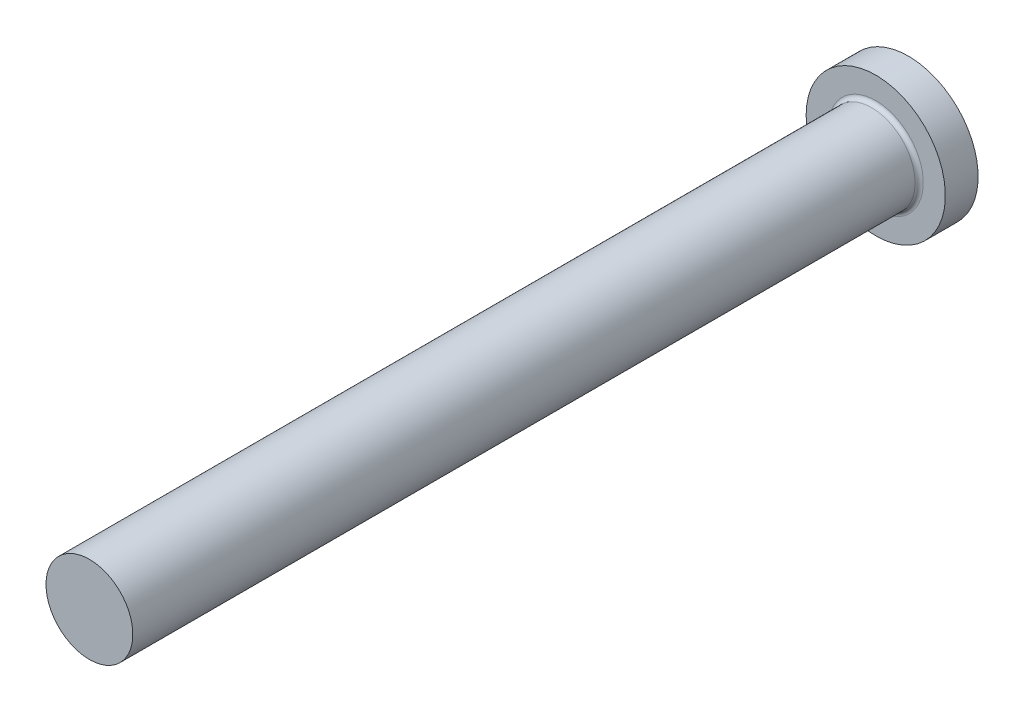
ISO-10303-21;
HEADER;
FILE_DESCRIPTION(('STEP AP214'),'2;1');
FILE_NAME('part.step','',(''),(''),'','','');
FILE_SCHEMA(('AUTOMOTIVE_DESIGN { 1 0 10303 214 1 1 1 1 }'));
ENDSEC;
DATA;
#1=APPLICATION_CONTEXT('core data for automotive mechanical design processes');
#2=APPLICATION_PROTOCOL_DEFINITION('international standard','automotive_design',2000,#1);
#3=PRODUCT_CONTEXT('',#1,'mechanical');
#4=PRODUCT('Part','Part','',(#3));
#5=PRODUCT_RELATED_PRODUCT_CATEGORY('part','',(#4));
#6=PRODUCT_DEFINITION_FORMATION('','',#4);
#7=PRODUCT_DEFINITION_CONTEXT('part definition',#1,'design');
#8=PRODUCT_DEFINITION('design','',#6,#7);
#9=PRODUCT_DEFINITION_SHAPE('','',#8);
#10=(LENGTH_UNIT() NAMED_UNIT(*) SI_UNIT(.MILLI.,.METRE.));
#11=(NAMED_UNIT(*) PLANE_ANGLE_UNIT() SI_UNIT($,.RADIAN.));
#12=(NAMED_UNIT(*) SI_UNIT($,.STERADIAN.) SOLID_ANGLE_UNIT());
#13=UNCERTAINTY_MEASURE_WITH_UNIT(LENGTH_MEASURE(1.E-05),#10,'distance_accuracy_value','');
#14=(GEOMETRIC_REPRESENTATION_CONTEXT(3) GLOBAL_UNCERTAINTY_ASSIGNED_CONTEXT((#13)) GLOBAL_UNIT_ASSIGNED_CONTEXT((#10,
#11,#12)) REPRESENTATION_CONTEXT('',''));
#15=CARTESIAN_POINT('',(0.,0.,0.));
#16=DIRECTION('',(0.,0.,1.));
#17=DIRECTION('',(1.,0.,0.));
#18=AXIS2_PLACEMENT_3D('',#15,#16,#17);
#19=CARTESIAN_POINT('',(8.5,0.,4.));
#20=DIRECTION('',(0.,0.,-1.));
#21=DIRECTION('',(-1.,0.,0.));
#22=AXIS2_PLACEMENT_3D('',#19,#20,#21);
#23=PLANE('',#22);
#24=CARTESIAN_POINT('',(0.,0.,4.));
#25=DIRECTION('',(0.,0.,-1.));
#26=DIRECTION('',(-1.,0.,0.));
#27=AXIS2_PLACEMENT_3D('',#24,#25,#26);
#28=CIRCLE('',#27,5.80000000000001);
#29=CARTESIAN_POINT('',(-5.80000000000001,0.,4.));
#30=VERTEX_POINT('',#29);
#31=EDGE_CURVE('E40',#30,#30,#28,.T.);
#32=ORIENTED_EDGE('',*,*,#31,.T.);
#33=EDGE_LOOP('',(#32));
#34=FACE_BOUND('',#33,.T.);
#35=CARTESIAN_POINT('',(0.,0.,4.));
#36=DIRECTION('',(0.,0.,-1.));
#37=DIRECTION('',(-1.,0.,0.));
#38=AXIS2_PLACEMENT_3D('',#35,#36,#37);
#39=CIRCLE('',#38,8.5);
#40=CARTESIAN_POINT('',(-8.5,0.,4.));
#41=VERTEX_POINT('',#40);
#42=EDGE_CURVE('E44',#41,#41,#39,.T.);
#43=ORIENTED_EDGE('',*,*,#42,.F.);
#44=EDGE_LOOP('',(#43));
#45=FACE_BOUND('',#44,.T.);
#46=ADVANCED_FACE('F33',(#34,#45),#23,.F.);
#47=CARTESIAN_POINT('',(0.,0.,-9.03322817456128));
#48=DIRECTION('',(0.,0.,-1.));
#49=DIRECTION('',(-1.,0.,0.));
#50=AXIS2_PLACEMENT_3D('',#47,#48,#49);
#51=CYLINDRICAL_SURFACE('',#50,8.5);
#52=CARTESIAN_POINT('',(0.,0.,0.));
#53=DIRECTION('',(0.,0.,-1.));
#54=DIRECTION('',(-1.,0.,0.));
#55=AXIS2_PLACEMENT_3D('',#52,#53,#54);
#56=CIRCLE('',#55,8.5);
#57=CARTESIAN_POINT('',(-8.5,0.,0.));
#58=VERTEX_POINT('',#57);
#59=EDGE_CURVE('E48',#58,#58,#56,.T.);
#60=ORIENTED_EDGE('',*,*,#59,.F.);
#61=EDGE_LOOP('',(#60));
#62=FACE_BOUND('',#61,.T.);
#63=ORIENTED_EDGE('',*,*,#42,.T.);
#64=EDGE_LOOP('',(#63));
#65=FACE_BOUND('',#64,.T.);
#66=ADVANCED_FACE('F68',(#62,#65),#51,.T.);
#67=CARTESIAN_POINT('',(0.,0.,0.));
#68=DIRECTION('',(0.,0.,1.));
#69=DIRECTION('',(1.,0.,0.));
#70=AXIS2_PLACEMENT_3D('',#67,#68,#69);
#71=PLANE('',#70);
#72=ORIENTED_EDGE('',*,*,#59,.T.);
#73=EDGE_LOOP('',(#72));
#74=FACE_BOUND('',#73,.T.);
#75=ADVANCED_FACE('F61',(#74),#71,.F.);
#76=CARTESIAN_POINT('',(0.,0.,100.));
#77=DIRECTION('',(0.,0.,-1.));
#78=DIRECTION('',(-1.,0.,0.));
#79=AXIS2_PLACEMENT_3D('',#76,#77,#78);
#80=PLANE('',#79);
#81=CARTESIAN_POINT('',(0.,0.,100.));
#82=DIRECTION('',(0.,0.,-1.));
#83=DIRECTION('',(-1.,0.,0.));
#84=AXIS2_PLACEMENT_3D('',#81,#82,#83);
#85=CIRCLE('',#84,5.30000000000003);
#86=CARTESIAN_POINT('',(-5.30000000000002,0.,100.));
#87=VERTEX_POINT('',#86);
#88=EDGE_CURVE('E53',#87,#87,#85,.T.);
#89=ORIENTED_EDGE('',*,*,#88,.F.);
#90=EDGE_LOOP('',(#89));
#91=FACE_BOUND('',#90,.T.);
#92=ADVANCED_FACE('F59',(#91),#80,.F.);
#93=CARTESIAN_POINT('',(0.,0.,-9.03322817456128));
#94=DIRECTION('',(0.,0.,-1.));
#95=DIRECTION('',(-1.,0.,0.));
#96=AXIS2_PLACEMENT_3D('',#93,#94,#95);
#97=CYLINDRICAL_SURFACE('',#96,5.30000000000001);
#98=CARTESIAN_POINT('',(0.,0.,4.5));
#99=DIRECTION('',(0.,0.,-1.));
#100=DIRECTION('',(-1.,0.,0.));
#101=AXIS2_PLACEMENT_3D('',#98,#99,#100);
#102=CIRCLE('',#101,5.30000000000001);
#103=CARTESIAN_POINT('',(-5.30000000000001,0.,4.5));
#104=VERTEX_POINT('',#103);
#105=EDGE_CURVE('E10',#104,#104,#102,.F.);
#106=ORIENTED_EDGE('',*,*,#105,.T.);
#107=EDGE_LOOP('',(#106));
#108=FACE_BOUND('',#107,.T.);
#109=ORIENTED_EDGE('',*,*,#88,.T.);
#110=EDGE_LOOP('',(#109));
#111=FACE_BOUND('',#110,.T.);
#112=ADVANCED_FACE('F57',(#108,#111),#97,.T.);
#113=CARTESIAN_POINT('',(0.,0.,4.5));
#114=DIRECTION('',(0.,0.,-1.));
#115=DIRECTION('',(-1.,0.,0.));
#116=AXIS2_PLACEMENT_3D('',#113,#114,#115);
#117=TOROIDAL_SURFACE('',#116,5.80000000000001,0.5);
#118=ORIENTED_EDGE('',*,*,#105,.F.);
#119=EDGE_LOOP('',(#118));
#120=FACE_BOUND('',#119,.T.);
#121=ORIENTED_EDGE('',*,*,#31,.F.);
#122=EDGE_LOOP('',(#121));
#123=FACE_BOUND('',#122,.T.);
#124=ADVANCED_FACE('F35',(#120,#123),#117,.F.);
#125=CLOSED_SHELL('',(#46,#66,#75,#92,#112,#124));
#126=MANIFOLD_SOLID_BREP('B2',#125);
#127=ADVANCED_BREP_SHAPE_REPRESENTATION('',(#18,#126),#14);
#128=SHAPE_DEFINITION_REPRESENTATION(#9,#127);
ENDSEC;
END-ISO-10303-21;
